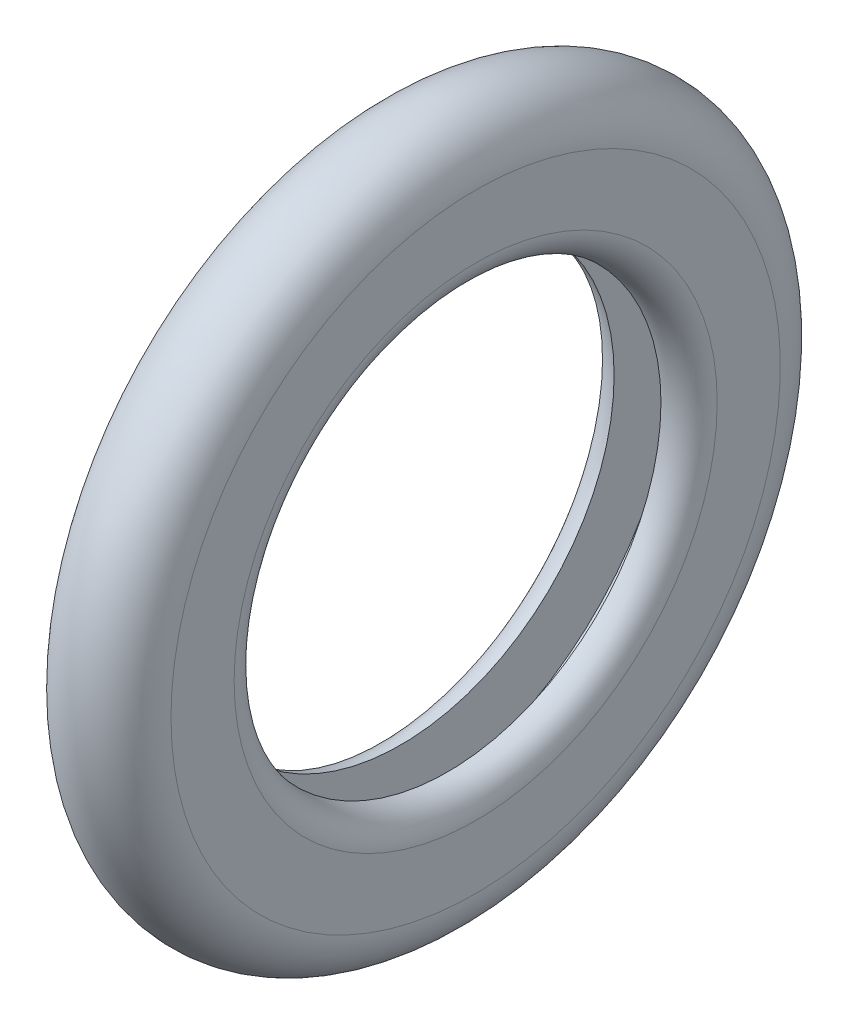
ISO-10303-21;
HEADER;
FILE_DESCRIPTION(('STEP AP214'),'2;1');
FILE_NAME('part.step','',(''),(''),'','','');
FILE_SCHEMA(('AUTOMOTIVE_DESIGN { 1 0 10303 214 1 1 1 1 }'));
ENDSEC;
DATA;
#1=APPLICATION_CONTEXT('core data for automotive mechanical design processes');
#2=APPLICATION_PROTOCOL_DEFINITION('international standard','automotive_design',2000,#1);
#3=PRODUCT_CONTEXT('',#1,'mechanical');
#4=PRODUCT('Part','Part','',(#3));
#5=PRODUCT_RELATED_PRODUCT_CATEGORY('part','',(#4));
#6=PRODUCT_DEFINITION_FORMATION('','',#4);
#7=PRODUCT_DEFINITION_CONTEXT('part definition',#1,'design');
#8=PRODUCT_DEFINITION('design','',#6,#7);
#9=PRODUCT_DEFINITION_SHAPE('','',#8);
#10=(LENGTH_UNIT() NAMED_UNIT(*) SI_UNIT(.MILLI.,.METRE.));
#11=(NAMED_UNIT(*) PLANE_ANGLE_UNIT() SI_UNIT($,.RADIAN.));
#12=(NAMED_UNIT(*) SI_UNIT($,.STERADIAN.) SOLID_ANGLE_UNIT());
#13=UNCERTAINTY_MEASURE_WITH_UNIT(LENGTH_MEASURE(1.E-05),#10,'distance_accuracy_value','');
#14=(GEOMETRIC_REPRESENTATION_CONTEXT(3) GLOBAL_UNCERTAINTY_ASSIGNED_CONTEXT((#13)) GLOBAL_UNIT_ASSIGNED_CONTEXT((#10,
#11,#12)) REPRESENTATION_CONTEXT('',''));
#15=CARTESIAN_POINT('',(0.,0.,0.));
#16=DIRECTION('',(0.,0.,1.));
#17=DIRECTION('',(1.,0.,0.));
#18=AXIS2_PLACEMENT_3D('',#15,#16,#17);
#19=CARTESIAN_POINT('',(6.985,0.,0.));
#20=DIRECTION('',(-1.,0.,0.));
#21=DIRECTION('',(0.,0.,1.));
#22=AXIS2_PLACEMENT_3D('',#19,#20,#21);
#23=TOROIDAL_SURFACE('',#22,41.3004,6.985);
#24=CARTESIAN_POINT('',(0.,0.,0.));
#25=DIRECTION('',(-1.,0.,0.));
#26=DIRECTION('',(0.,0.,1.));
#27=AXIS2_PLACEMENT_3D('',#24,#25,#26);
#28=CIRCLE('',#27,41.3004);
#29=CARTESIAN_POINT('',(0.,0.,41.3004));
#30=VERTEX_POINT('',#29);
#31=EDGE_CURVE('E34',#30,#30,#28,.T.);
#32=ORIENTED_EDGE('',*,*,#31,.F.);
#33=EDGE_LOOP('',(#32));
#34=FACE_BOUND('',#33,.T.);
#35=CARTESIAN_POINT('',(13.97,0.,0.));
#36=DIRECTION('',(-1.,0.,0.));
#37=DIRECTION('',(0.,0.,1.));
#38=AXIS2_PLACEMENT_3D('',#35,#36,#37);
#39=CIRCLE('',#38,41.3004);
#40=CARTESIAN_POINT('',(13.97,0.,41.3004));
#41=VERTEX_POINT('',#40);
#42=EDGE_CURVE('E52',#41,#41,#39,.T.);
#43=ORIENTED_EDGE('',*,*,#42,.T.);
#44=EDGE_LOOP('',(#43));
#45=FACE_BOUND('',#44,.T.);
#46=ADVANCED_FACE('F24',(#34,#45),#23,.T.);
#47=CARTESIAN_POINT('',(0.,41.3004,0.));
#48=DIRECTION('',(1.,0.,0.));
#49=DIRECTION('',(0.,0.,-1.));
#50=AXIS2_PLACEMENT_3D('',#47,#48,#49);
#51=PLANE('',#50);
#52=CARTESIAN_POINT('',(0.,0.,0.));
#53=DIRECTION('',(1.,0.,0.));
#54=DIRECTION('',(0.,0.,-1.));
#55=AXIS2_PLACEMENT_3D('',#52,#53,#54);
#56=CIRCLE('',#55,32.7406);
#57=CARTESIAN_POINT('',(0.,0.,-32.7406));
#58=VERTEX_POINT('',#57);
#59=EDGE_CURVE('E30',#58,#58,#56,.T.);
#60=ORIENTED_EDGE('',*,*,#59,.T.);
#61=EDGE_LOOP('',(#60));
#62=FACE_BOUND('',#61,.T.);
#63=ORIENTED_EDGE('',*,*,#31,.T.);
#64=EDGE_LOOP('',(#63));
#65=FACE_BOUND('',#64,.T.);
#66=ADVANCED_FACE('F74',(#62,#65),#51,.F.);
#67=CARTESIAN_POINT('',(3.81,28.9306,0.));
#68=DIRECTION('',(-1.,0.,0.));
#69=DIRECTION('',(0.,0.,1.));
#70=AXIS2_PLACEMENT_3D('',#67,#68,#69);
#71=PLANE('',#70);
#72=CARTESIAN_POINT('',(3.81,0.,0.));
#73=DIRECTION('',(-1.,0.,0.));
#74=DIRECTION('',(0.,0.,1.));
#75=AXIS2_PLACEMENT_3D('',#72,#73,#74);
#76=CIRCLE('',#75,37.465);
#77=CARTESIAN_POINT('',(3.81,0.,37.465));
#78=VERTEX_POINT('',#77);
#79=EDGE_CURVE('E43',#78,#78,#76,.T.);
#80=ORIENTED_EDGE('',*,*,#79,.F.);
#81=EDGE_LOOP('',(#80));
#82=FACE_BOUND('',#81,.T.);
#83=CARTESIAN_POINT('',(3.81,0.,0.));
#84=DIRECTION('',(-1.,0.,0.));
#85=DIRECTION('',(0.,0.,1.));
#86=AXIS2_PLACEMENT_3D('',#83,#84,#85);
#87=CIRCLE('',#86,28.9306);
#88=CARTESIAN_POINT('',(3.81,0.,28.9306));
#89=VERTEX_POINT('',#88);
#90=EDGE_CURVE('E38',#89,#89,#87,.T.);
#91=ORIENTED_EDGE('',*,*,#90,.T.);
#92=EDGE_LOOP('',(#91));
#93=FACE_BOUND('',#92,.T.);
#94=ADVANCED_FACE('F79',(#82,#93),#71,.F.);
#95=CARTESIAN_POINT('',(0.,0.,0.));
#96=DIRECTION('',(-1.,0.,0.));
#97=DIRECTION('',(0.,0.,1.));
#98=AXIS2_PLACEMENT_3D('',#95,#96,#97);
#99=CYLINDRICAL_SURFACE('',#98,37.465);
#100=CARTESIAN_POINT('',(10.16,0.,0.));
#101=DIRECTION('',(-1.,0.,0.));
#102=DIRECTION('',(0.,0.,1.));
#103=AXIS2_PLACEMENT_3D('',#100,#101,#102);
#104=CIRCLE('',#103,37.465);
#105=CARTESIAN_POINT('',(10.16,0.,37.465));
#106=VERTEX_POINT('',#105);
#107=EDGE_CURVE('E46',#106,#106,#104,.T.);
#108=ORIENTED_EDGE('',*,*,#107,.F.);
#109=EDGE_LOOP('',(#108));
#110=FACE_BOUND('',#109,.T.);
#111=ORIENTED_EDGE('',*,*,#79,.T.);
#112=EDGE_LOOP('',(#111));
#113=FACE_BOUND('',#112,.T.);
#114=ADVANCED_FACE('F70',(#110,#113),#99,.F.);
#115=CARTESIAN_POINT('',(10.16,28.9306,0.));
#116=DIRECTION('',(1.,0.,0.));
#117=DIRECTION('',(0.,0.,-1.));
#118=AXIS2_PLACEMENT_3D('',#115,#116,#117);
#119=PLANE('',#118);
#120=CARTESIAN_POINT('',(10.16,0.,0.));
#121=DIRECTION('',(-1.,0.,0.));
#122=DIRECTION('',(0.,0.,1.));
#123=AXIS2_PLACEMENT_3D('',#120,#121,#122);
#124=CIRCLE('',#123,28.9306);
#125=CARTESIAN_POINT('',(10.16,0.,28.9306));
#126=VERTEX_POINT('',#125);
#127=EDGE_CURVE('E49',#126,#126,#124,.T.);
#128=ORIENTED_EDGE('',*,*,#127,.F.);
#129=EDGE_LOOP('',(#128));
#130=FACE_BOUND('',#129,.T.);
#131=ORIENTED_EDGE('',*,*,#107,.T.);
#132=EDGE_LOOP('',(#131));
#133=FACE_BOUND('',#132,.T.);
#134=ADVANCED_FACE('F60',(#130,#133),#119,.F.);
#135=CARTESIAN_POINT('',(13.97,41.3004,0.));
#136=DIRECTION('',(-1.,0.,0.));
#137=DIRECTION('',(0.,0.,1.));
#138=AXIS2_PLACEMENT_3D('',#135,#136,#137);
#139=PLANE('',#138);
#140=CARTESIAN_POINT('',(13.97,0.,0.));
#141=DIRECTION('',(-1.,0.,0.));
#142=DIRECTION('',(0.,0.,1.));
#143=AXIS2_PLACEMENT_3D('',#140,#141,#142);
#144=CIRCLE('',#143,32.7406);
#145=CARTESIAN_POINT('',(13.97,0.,32.7406));
#146=VERTEX_POINT('',#145);
#147=EDGE_CURVE('E10',#146,#146,#144,.T.);
#148=ORIENTED_EDGE('',*,*,#147,.T.);
#149=EDGE_LOOP('',(#148));
#150=FACE_BOUND('',#149,.T.);
#151=ORIENTED_EDGE('',*,*,#42,.F.);
#152=EDGE_LOOP('',(#151));
#153=FACE_BOUND('',#152,.T.);
#154=ADVANCED_FACE('F57',(#150,#153),#139,.F.);
#155=CARTESIAN_POINT('',(3.81,0.,0.));
#156=DIRECTION('',(1.,0.,0.));
#157=DIRECTION('',(0.,0.,-1.));
#158=AXIS2_PLACEMENT_3D('',#155,#156,#157);
#159=TOROIDAL_SURFACE('',#158,32.7406,3.81);
#160=ORIENTED_EDGE('',*,*,#59,.F.);
#161=EDGE_LOOP('',(#160));
#162=FACE_BOUND('',#161,.T.);
#163=ORIENTED_EDGE('',*,*,#90,.F.);
#164=EDGE_LOOP('',(#163));
#165=FACE_BOUND('',#164,.T.);
#166=ADVANCED_FACE('F59',(#162,#165),#159,.T.);
#167=CARTESIAN_POINT('',(10.16,0.,0.));
#168=DIRECTION('',(-1.,0.,0.));
#169=DIRECTION('',(0.,0.,1.));
#170=AXIS2_PLACEMENT_3D('',#167,#168,#169);
#171=TOROIDAL_SURFACE('',#170,32.7406,3.81);
#172=ORIENTED_EDGE('',*,*,#127,.T.);
#173=EDGE_LOOP('',(#172));
#174=FACE_BOUND('',#173,.T.);
#175=ORIENTED_EDGE('',*,*,#147,.F.);
#176=EDGE_LOOP('',(#175));
#177=FACE_BOUND('',#176,.T.);
#178=ADVANCED_FACE('F66',(#174,#177),#171,.T.);
#179=CLOSED_SHELL('',(#46,#66,#94,#114,#134,#154,#166,#178));
#180=MANIFOLD_SOLID_BREP('B2',#179);
#181=ADVANCED_BREP_SHAPE_REPRESENTATION('',(#18,#180),#14);
#182=SHAPE_DEFINITION_REPRESENTATION(#9,#181);
ENDSEC;
END-ISO-10303-21;
